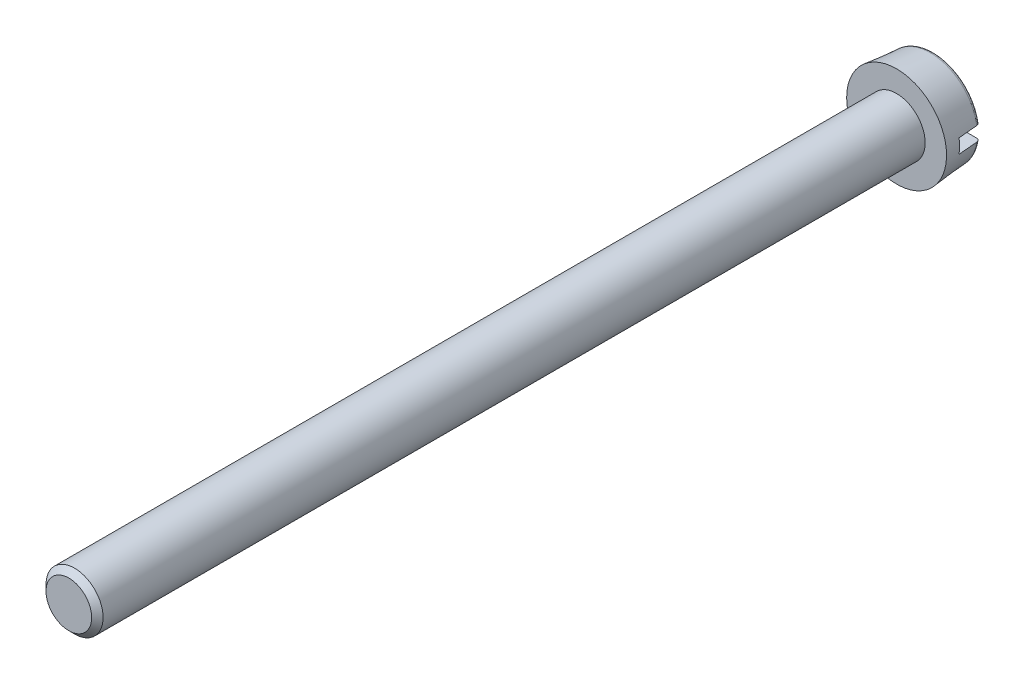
from build123d import *

# Parameters (mm, degrees)
ESQUISSE2_W             = 7
ESQUISSE2_H             = 1
ENLEV_MAT_EXTRU_1_DEPTH = 1.6
ESQUISSE3_W             = 2
ESQUISSE3_H             = 58
CHANFREIN1_SIZE         = 0.4


with BuildPart() as part:
    # Esquisse1 → Base-R_volution (revolve)
    with BuildSketch(Plane(origin=(0, 0, 0), x_dir=(1, 0, 0), z_dir=(0, 1, 0))):
        with BuildLine():
            Line((0, 0), (3.5, 0))
            Line((3.5, 0), (3.293293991, 2.362660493))
            ThreePointArc((3.293293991, 2.362660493), (3.209936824, 2.531692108), (3.03428337, 2.6))
            Line((3.03428337, 2.6), (0, 2.6))
            Line((0, 2.6), (0, 0))
        make_face()
    revolve(axis=Axis((0, 0, 0), (0, 0, -1)))

    # Esquisse2 → Enlev. mat.-Extru.1 (cut)
    with BuildSketch(Plane.XY.offset(-2.6)):
        Rectangle(ESQUISSE2_W, ESQUISSE2_H)
    extrude(amount=ENLEV_MAT_EXTRU_1_DEPTH, mode=Mode.SUBTRACT)

    # Esquisse3 → Boss.-R_vol.1 (revolve)
    with BuildSketch(Plane(origin=(0, 0, 0), x_dir=(1, 0, 0), z_dir=(0, 1, 0))):
        with Locations((1, -29)):
            Rectangle(ESQUISSE3_W, ESQUISSE3_H)
    revolve(axis=Axis((0, 0, 0), (0, 0, 1)))

    # Chanfrein1
    chanfrein1_edges = [part.edges().sort_by_distance(p)[0] for p in [
        (-2, 0, 58),
    ]]
    chamfer(chanfrein1_edges, length=CHANFREIN1_SIZE)


solid = part.part
